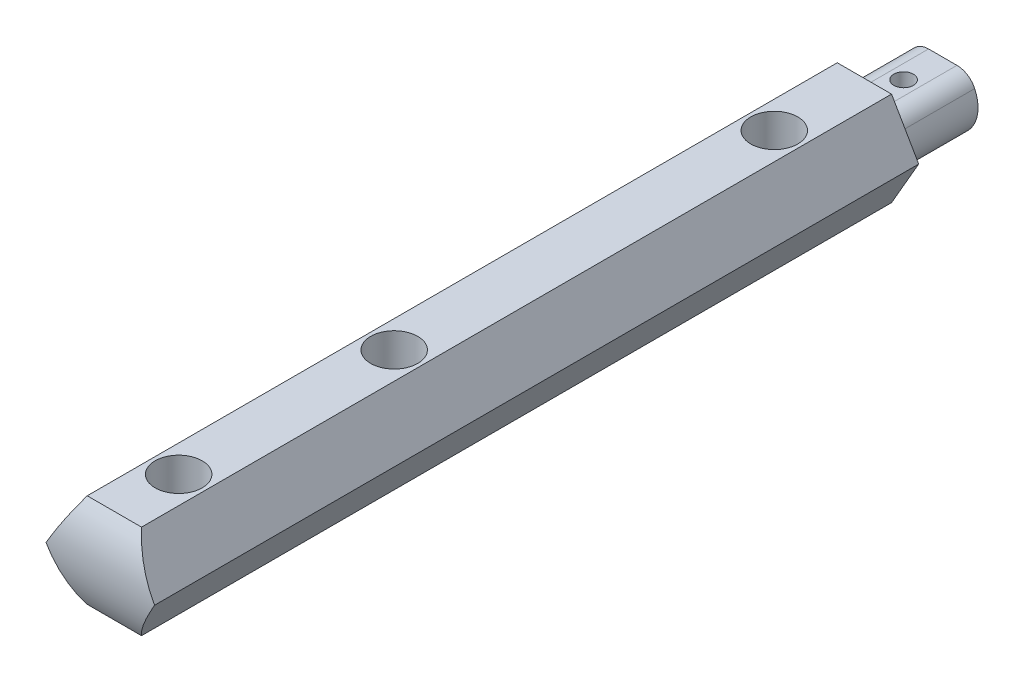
ISO-10303-21;
HEADER;
FILE_DESCRIPTION(('STEP AP214'),'2;1');
FILE_NAME('part.step','',(''),(''),'','','');
FILE_SCHEMA(('AUTOMOTIVE_DESIGN { 1 0 10303 214 1 1 1 1 }'));
ENDSEC;
DATA;
#1=APPLICATION_CONTEXT('core data for automotive mechanical design processes');
#2=APPLICATION_PROTOCOL_DEFINITION('international standard','automotive_design',2000,#1);
#3=PRODUCT_CONTEXT('',#1,'mechanical');
#4=PRODUCT('Part','Part','',(#3));
#5=PRODUCT_RELATED_PRODUCT_CATEGORY('part','',(#4));
#6=PRODUCT_DEFINITION_FORMATION('','',#4);
#7=PRODUCT_DEFINITION_CONTEXT('part definition',#1,'design');
#8=PRODUCT_DEFINITION('design','',#6,#7);
#9=PRODUCT_DEFINITION_SHAPE('','',#8);
#10=(LENGTH_UNIT() NAMED_UNIT(*) SI_UNIT(.MILLI.,.METRE.));
#11=(NAMED_UNIT(*) PLANE_ANGLE_UNIT() SI_UNIT($,.RADIAN.));
#12=(NAMED_UNIT(*) SI_UNIT($,.STERADIAN.) SOLID_ANGLE_UNIT());
#13=UNCERTAINTY_MEASURE_WITH_UNIT(LENGTH_MEASURE(1.E-05),#10,'distance_accuracy_value','');
#14=(GEOMETRIC_REPRESENTATION_CONTEXT(3) GLOBAL_UNCERTAINTY_ASSIGNED_CONTEXT((#13)) GLOBAL_UNIT_ASSIGNED_CONTEXT((#10,
#11,#12)) REPRESENTATION_CONTEXT('',''));
#15=CARTESIAN_POINT('',(0.,0.,0.));
#16=DIRECTION('',(0.,0.,1.));
#17=DIRECTION('',(1.,0.,0.));
#18=AXIS2_PLACEMENT_3D('',#15,#16,#17);
#19=CARTESIAN_POINT('',(0.,0.,0.));
#20=DIRECTION('',(0.,0.,1.));
#21=DIRECTION('',(1.,0.,0.));
#22=AXIS2_PLACEMENT_3D('',#19,#20,#21);
#23=PLANE('',#22);
#24=DIRECTION('',(-0.5,-0.866025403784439,0.));
#25=VECTOR('',#24,1.);
#26=CARTESIAN_POINT('',(-6.92820323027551,12.,0.));
#27=LINE('',#26,#25);
#28=CARTESIAN_POINT('',(-6.92820323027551,12.,0.));
#29=VERTEX_POINT('',#28);
#30=CARTESIAN_POINT('',(-13.856406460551,0.,0.));
#31=VERTEX_POINT('',#30);
#32=EDGE_CURVE('E161',#29,#31,#27,.T.);
#33=ORIENTED_EDGE('',*,*,#32,.F.);
#34=DIRECTION('',(-1.,0.,0.));
#35=VECTOR('',#34,1.);
#36=CARTESIAN_POINT('',(6.9282032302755,12.,0.));
#37=LINE('',#36,#35);
#38=CARTESIAN_POINT('',(6.9282032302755,12.,0.));
#39=VERTEX_POINT('',#38);
#40=EDGE_CURVE('E169',#39,#29,#37,.T.);
#41=ORIENTED_EDGE('',*,*,#40,.F.);
#42=DIRECTION('',(-0.5,0.866025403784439,0.));
#43=VECTOR('',#42,1.);
#44=CARTESIAN_POINT('',(13.856406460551,0.,0.));
#45=LINE('',#44,#43);
#46=CARTESIAN_POINT('',(13.856406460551,0.,0.));
#47=VERTEX_POINT('',#46);
#48=EDGE_CURVE('E164',#47,#39,#45,.T.);
#49=ORIENTED_EDGE('',*,*,#48,.F.);
#50=DIRECTION('',(0.499999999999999,0.866025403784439,0.));
#51=VECTOR('',#50,1.);
#52=CARTESIAN_POINT('',(6.92820323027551,-12.,0.));
#53=LINE('',#52,#51);
#54=CARTESIAN_POINT('',(6.92820323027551,-12.,0.));
#55=VERTEX_POINT('',#54);
#56=EDGE_CURVE('E138',#55,#47,#53,.T.);
#57=ORIENTED_EDGE('',*,*,#56,.F.);
#58=DIRECTION('',(1.,0.,0.));
#59=VECTOR('',#58,1.);
#60=CARTESIAN_POINT('',(-6.92820323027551,-12.,0.));
#61=LINE('',#60,#59);
#62=CARTESIAN_POINT('',(-6.92820323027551,-12.,0.));
#63=VERTEX_POINT('',#62);
#64=EDGE_CURVE('E152',#63,#55,#61,.T.);
#65=ORIENTED_EDGE('',*,*,#64,.F.);
#66=DIRECTION('',(0.5,-0.866025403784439,0.));
#67=VECTOR('',#66,1.);
#68=CARTESIAN_POINT('',(-13.856406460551,0.,0.));
#69=LINE('',#68,#67);
#70=EDGE_CURVE('E155',#31,#63,#69,.T.);
#71=ORIENTED_EDGE('',*,*,#70,.F.);
#72=EDGE_LOOP('',(#33,#41,#49,#57,#65,#71));
#73=FACE_BOUND('',#72,.T.);
#74=CARTESIAN_POINT('',(-3.62077339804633,1.7,0.));
#75=DIRECTION('',(0.,0.,-1.));
#76=DIRECTION('',(-1.,0.,0.));
#77=AXIS2_PLACEMENT_3D('',#74,#75,#76);
#78=CIRCLE('',#77,5.);
#79=CARTESIAN_POINT('',(-8.14674014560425,3.825,0.));
#80=VERTEX_POINT('',#79);
#81=CARTESIAN_POINT('',(-3.62077339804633,6.7,0.));
#82=VERTEX_POINT('',#81);
#83=EDGE_CURVE('E65',#80,#82,#78,.T.);
#84=ORIENTED_EDGE('',*,*,#83,.F.);
#85=CARTESIAN_POINT('',(0.,0.,0.));
#86=DIRECTION('',(0.,0.,-1.));
#87=DIRECTION('',(-1.,0.,0.));
#88=AXIS2_PLACEMENT_3D('',#85,#86,#87);
#89=CIRCLE('',#88,9.);
#90=CARTESIAN_POINT('',(8.14674014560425,3.825,0.));
#91=VERTEX_POINT('',#90);
#92=EDGE_CURVE('E191',#91,#80,#89,.T.);
#93=ORIENTED_EDGE('',*,*,#92,.F.);
#94=CARTESIAN_POINT('',(3.62077339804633,1.7,0.));
#95=DIRECTION('',(0.,0.,-1.));
#96=DIRECTION('',(-1.,0.,0.));
#97=AXIS2_PLACEMENT_3D('',#94,#95,#96);
#98=CIRCLE('',#97,5.);
#99=CARTESIAN_POINT('',(3.62077339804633,6.7,0.));
#100=VERTEX_POINT('',#99);
#101=EDGE_CURVE('E194',#100,#91,#98,.T.);
#102=ORIENTED_EDGE('',*,*,#101,.F.);
#103=DIRECTION('',(1.,0.,0.));
#104=VECTOR('',#103,1.);
#105=CARTESIAN_POINT('',(3.62077339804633,6.7,0.));
#106=LINE('',#105,#104);
#107=EDGE_CURVE('E197',#82,#100,#106,.T.);
#108=ORIENTED_EDGE('',*,*,#107,.F.);
#109=EDGE_LOOP('',(#84,#93,#102,#108));
#110=FACE_BOUND('',#109,.T.);
#111=ADVANCED_FACE('F36',(#73,#110),#23,.F.);
#112=CARTESIAN_POINT('',(-6.92820323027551,12.,195.));
#113=DIRECTION('',(0.866025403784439,-0.5,0.));
#114=DIRECTION('',(0.5,0.866025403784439,0.));
#115=AXIS2_PLACEMENT_3D('',#112,#113,#114);
#116=PLANE('',#115);
#117=DIRECTION('',(0.,0.,-1.));
#118=VECTOR('',#117,1.);
#119=CARTESIAN_POINT('',(-13.856406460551,0.,195.));
#120=LINE('',#119,#118);
#121=CARTESIAN_POINT('',(-13.856406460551,0.,195.));
#122=VERTEX_POINT('',#121);
#123=EDGE_CURVE('E11',#122,#31,#120,.T.);
#124=ORIENTED_EDGE('',*,*,#123,.F.);
#125=CARTESIAN_POINT('',(-13.856406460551,0.,173.153308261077));
#126=DIRECTION('',(0.866025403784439,-0.5,0.));
#127=DIRECTION('',(0.5,0.866025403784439,0.));
#128=AXIS2_PLACEMENT_3D('',#125,#126,#127);
#129=ELLIPSE('',#128,25.22638671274,21.846691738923);
#130=CARTESIAN_POINT('',(-6.92820323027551,12.,191.409209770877));
#131=VERTEX_POINT('',#130);
#132=EDGE_CURVE('E124',#122,#131,#129,.F.);
#133=ORIENTED_EDGE('',*,*,#132,.T.);
#134=DIRECTION('',(0.,0.,-1.));
#135=VECTOR('',#134,1.);
#136=CARTESIAN_POINT('',(-6.92820323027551,12.,195.));
#137=LINE('',#136,#135);
#138=EDGE_CURVE('E142',#131,#29,#137,.T.);
#139=ORIENTED_EDGE('',*,*,#138,.T.);
#140=ORIENTED_EDGE('',*,*,#32,.T.);
#141=EDGE_LOOP('',(#124,#133,#139,#140));
#142=FACE_BOUND('',#141,.T.);
#143=ADVANCED_FACE('F38',(#142),#116,.F.);
#144=CARTESIAN_POINT('',(-13.856406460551,0.,195.));
#145=DIRECTION('',(0.866025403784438,0.5,0.));
#146=DIRECTION('',(-0.5,0.866025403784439,0.));
#147=AXIS2_PLACEMENT_3D('',#144,#145,#146);
#148=PLANE('',#147);
#149=DIRECTION('',(0.,0.,-1.));
#150=VECTOR('',#149,1.);
#151=CARTESIAN_POINT('',(-6.92820323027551,-12.,195.));
#152=LINE('',#151,#150);
#153=CARTESIAN_POINT('',(-6.92820323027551,-12.,191.409209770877));
#154=VERTEX_POINT('',#153);
#155=EDGE_CURVE('E50',#154,#63,#152,.T.);
#156=ORIENTED_EDGE('',*,*,#155,.F.);
#157=CARTESIAN_POINT('',(-13.856406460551,0.,173.153308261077));
#158=DIRECTION('',(0.866025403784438,0.5,0.));
#159=DIRECTION('',(0.5,-0.866025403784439,0.));
#160=AXIS2_PLACEMENT_3D('',#157,#158,#159);
#161=ELLIPSE('',#160,25.22638671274,21.846691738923);
#162=EDGE_CURVE('E125',#154,#122,#161,.F.);
#163=ORIENTED_EDGE('',*,*,#162,.T.);
#164=ORIENTED_EDGE('',*,*,#123,.T.);
#165=ORIENTED_EDGE('',*,*,#70,.T.);
#166=EDGE_LOOP('',(#156,#163,#164,#165));
#167=FACE_BOUND('',#166,.T.);
#168=ADVANCED_FACE('F156',(#167),#148,.F.);
#169=CARTESIAN_POINT('',(-6.92820323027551,-12.,195.));
#170=DIRECTION('',(0.,1.,0.));
#171=DIRECTION('',(-1.,0.,0.));
#172=AXIS2_PLACEMENT_3D('',#169,#170,#171);
#173=PLANE('',#172);
#174=CARTESIAN_POINT('',(0.,-12.,23.));
#175=DIRECTION('',(0.,1.,0.));
#176=DIRECTION('',(0.,0.,1.));
#177=AXIS2_PLACEMENT_3D('',#174,#175,#176);
#178=CIRCLE('',#177,3.25);
#179=CARTESIAN_POINT('',(0.,-12.,26.25));
#180=VERTEX_POINT('',#179);
#181=EDGE_CURVE('E246',#180,#180,#178,.T.);
#182=ORIENTED_EDGE('',*,*,#181,.T.);
#183=EDGE_LOOP('',(#182));
#184=FACE_BOUND('',#183,.T.);
#185=CARTESIAN_POINT('',(0.,-12.,120.));
#186=DIRECTION('',(0.,-1.,0.));
#187=DIRECTION('',(0.,0.,-1.));
#188=AXIS2_PLACEMENT_3D('',#185,#186,#187);
#189=CIRCLE('',#188,4.00555020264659);
#190=CARTESIAN_POINT('',(0.,-12.,115.994449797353));
#191=VERTEX_POINT('',#190);
#192=EDGE_CURVE('E234',#191,#191,#189,.T.);
#193=ORIENTED_EDGE('',*,*,#192,.F.);
#194=EDGE_LOOP('',(#193));
#195=FACE_BOUND('',#194,.T.);
#196=CARTESIAN_POINT('',(0.,-12.,175.));
#197=DIRECTION('',(0.,-1.,0.));
#198=DIRECTION('',(0.,0.,-1.));
#199=AXIS2_PLACEMENT_3D('',#196,#197,#198);
#200=CIRCLE('',#199,4.00555020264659);
#201=CARTESIAN_POINT('',(0.,-12.,170.994449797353));
#202=VERTEX_POINT('',#201);
#203=EDGE_CURVE('E222',#202,#202,#200,.T.);
#204=ORIENTED_EDGE('',*,*,#203,.F.);
#205=EDGE_LOOP('',(#204));
#206=FACE_BOUND('',#205,.T.);
#207=DIRECTION('',(0.,0.,-1.));
#208=VECTOR('',#207,1.);
#209=CARTESIAN_POINT('',(6.92820323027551,-12.,195.));
#210=LINE('',#209,#208);
#211=CARTESIAN_POINT('',(6.92820323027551,-12.,191.409209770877));
#212=VERTEX_POINT('',#211);
#213=EDGE_CURVE('E139',#212,#55,#210,.T.);
#214=ORIENTED_EDGE('',*,*,#213,.F.);
#215=DIRECTION('',(1.,0.,0.));
#216=VECTOR('',#215,1.);
#217=CARTESIAN_POINT('',(-13.856406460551,-12.,191.409209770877));
#218=LINE('',#217,#216);
#219=EDGE_CURVE('E120',#154,#212,#218,.T.);
#220=ORIENTED_EDGE('',*,*,#219,.F.);
#221=ORIENTED_EDGE('',*,*,#155,.T.);
#222=ORIENTED_EDGE('',*,*,#64,.T.);
#223=EDGE_LOOP('',(#214,#220,#221,#222));
#224=FACE_BOUND('',#223,.T.);
#225=ADVANCED_FACE('F150',(#184,#195,#206,#224),#173,.F.);
#226=CARTESIAN_POINT('',(6.92820323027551,-12.,195.));
#227=DIRECTION('',(-0.866025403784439,0.499999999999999,0.));
#228=DIRECTION('',(-0.499999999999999,-0.866025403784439,0.));
#229=AXIS2_PLACEMENT_3D('',#226,#227,#228);
#230=PLANE('',#229);
#231=DIRECTION('',(0.,0.,-1.));
#232=VECTOR('',#231,1.);
#233=CARTESIAN_POINT('',(13.856406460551,0.,195.));
#234=LINE('',#233,#232);
#235=CARTESIAN_POINT('',(13.856406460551,0.,195.));
#236=VERTEX_POINT('',#235);
#237=EDGE_CURVE('E132',#236,#47,#234,.T.);
#238=ORIENTED_EDGE('',*,*,#237,.F.);
#239=CARTESIAN_POINT('',(13.856406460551,0.,173.153308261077));
#240=DIRECTION('',(-0.866025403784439,0.499999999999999,0.));
#241=DIRECTION('',(0.499999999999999,0.866025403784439,0.));
#242=AXIS2_PLACEMENT_3D('',#239,#240,#241);
#243=ELLIPSE('',#242,25.22638671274,21.846691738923);
#244=EDGE_CURVE('E117',#236,#212,#243,.F.);
#245=ORIENTED_EDGE('',*,*,#244,.T.);
#246=ORIENTED_EDGE('',*,*,#213,.T.);
#247=ORIENTED_EDGE('',*,*,#56,.T.);
#248=EDGE_LOOP('',(#238,#245,#246,#247));
#249=FACE_BOUND('',#248,.T.);
#250=ADVANCED_FACE('F136',(#249),#230,.F.);
#251=CARTESIAN_POINT('',(13.856406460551,0.,195.));
#252=DIRECTION('',(-0.866025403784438,-0.5,0.));
#253=DIRECTION('',(0.5,-0.866025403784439,0.));
#254=AXIS2_PLACEMENT_3D('',#251,#252,#253);
#255=PLANE('',#254);
#256=DIRECTION('',(0.,0.,-1.));
#257=VECTOR('',#256,1.);
#258=CARTESIAN_POINT('',(6.9282032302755,12.,195.));
#259=LINE('',#258,#257);
#260=CARTESIAN_POINT('',(6.9282032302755,12.,191.409209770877));
#261=VERTEX_POINT('',#260);
#262=EDGE_CURVE('E134',#261,#39,#259,.T.);
#263=ORIENTED_EDGE('',*,*,#262,.F.);
#264=CARTESIAN_POINT('',(13.856406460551,0.,173.153308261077));
#265=DIRECTION('',(-0.866025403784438,-0.5,0.));
#266=DIRECTION('',(0.5,-0.866025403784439,0.));
#267=AXIS2_PLACEMENT_3D('',#264,#265,#266);
#268=ELLIPSE('',#267,25.22638671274,21.846691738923);
#269=EDGE_CURVE('E57',#261,#236,#268,.F.);
#270=ORIENTED_EDGE('',*,*,#269,.T.);
#271=ORIENTED_EDGE('',*,*,#237,.T.);
#272=ORIENTED_EDGE('',*,*,#48,.T.);
#273=EDGE_LOOP('',(#263,#270,#271,#272));
#274=FACE_BOUND('',#273,.T.);
#275=ADVANCED_FACE('F130',(#274),#255,.F.);
#276=CARTESIAN_POINT('',(6.9282032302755,12.,195.));
#277=DIRECTION('',(0.,-1.,0.));
#278=DIRECTION('',(0.,0.,-1.));
#279=AXIS2_PLACEMENT_3D('',#276,#277,#278);
#280=PLANE('',#279);
#281=CARTESIAN_POINT('',(0.,12.,23.));
#282=DIRECTION('',(0.,1.,0.));
#283=DIRECTION('',(0.,0.,1.));
#284=AXIS2_PLACEMENT_3D('',#281,#282,#283);
#285=CIRCLE('',#284,6.);
#286=CARTESIAN_POINT('',(0.,12.,29.));
#287=VERTEX_POINT('',#286);
#288=EDGE_CURVE('E237',#287,#287,#285,.T.);
#289=ORIENTED_EDGE('',*,*,#288,.F.);
#290=EDGE_LOOP('',(#289));
#291=FACE_BOUND('',#290,.T.);
#292=CARTESIAN_POINT('',(0.,12.,120.));
#293=DIRECTION('',(0.,-1.,0.));
#294=DIRECTION('',(0.,0.,-1.));
#295=AXIS2_PLACEMENT_3D('',#292,#293,#294);
#296=CIRCLE('',#295,6.00000000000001);
#297=CARTESIAN_POINT('',(0.,12.,114.));
#298=VERTEX_POINT('',#297);
#299=EDGE_CURVE('E225',#298,#298,#296,.T.);
#300=ORIENTED_EDGE('',*,*,#299,.T.);
#301=EDGE_LOOP('',(#300));
#302=FACE_BOUND('',#301,.T.);
#303=CARTESIAN_POINT('',(0.,12.,175.));
#304=DIRECTION('',(0.,-1.,0.));
#305=DIRECTION('',(0.,0.,-1.));
#306=AXIS2_PLACEMENT_3D('',#303,#304,#305);
#307=CIRCLE('',#306,6.00000000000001);
#308=CARTESIAN_POINT('',(0.,12.,169.));
#309=VERTEX_POINT('',#308);
#310=EDGE_CURVE('E212',#309,#309,#307,.T.);
#311=ORIENTED_EDGE('',*,*,#310,.T.);
#312=EDGE_LOOP('',(#311));
#313=FACE_BOUND('',#312,.T.);
#314=ORIENTED_EDGE('',*,*,#138,.F.);
#315=DIRECTION('',(1.,0.,0.));
#316=VECTOR('',#315,1.);
#317=CARTESIAN_POINT('',(-13.856406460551,12.,191.409209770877));
#318=LINE('',#317,#316);
#319=EDGE_CURVE('E210',#131,#261,#318,.T.);
#320=ORIENTED_EDGE('',*,*,#319,.T.);
#321=ORIENTED_EDGE('',*,*,#262,.T.);
#322=ORIENTED_EDGE('',*,*,#40,.T.);
#323=EDGE_LOOP('',(#314,#320,#321,#322));
#324=FACE_BOUND('',#323,.T.);
#325=ADVANCED_FACE('F176',(#291,#302,#313,#324),#280,.F.);
#326=CARTESIAN_POINT('',(-3.62077339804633,1.7,-20.));
#327=DIRECTION('',(0.,0.,1.));
#328=DIRECTION('',(1.,0.,0.));
#329=AXIS2_PLACEMENT_3D('',#326,#327,#328);
#330=CYLINDRICAL_SURFACE('',#329,5.);
#331=ORIENTED_EDGE('',*,*,#83,.T.);
#332=DIRECTION('',(0.,0.,1.));
#333=VECTOR('',#332,1.);
#334=CARTESIAN_POINT('',(-3.62077339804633,6.7,-20.));
#335=LINE('',#334,#333);
#336=CARTESIAN_POINT('',(-3.62077339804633,6.7,-20.));
#337=VERTEX_POINT('',#336);
#338=EDGE_CURVE('E177',#337,#82,#335,.T.);
#339=ORIENTED_EDGE('',*,*,#338,.F.);
#340=CARTESIAN_POINT('',(-3.62077339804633,1.7,-20.));
#341=DIRECTION('',(0.,0.,-1.));
#342=DIRECTION('',(-1.,0.,0.));
#343=AXIS2_PLACEMENT_3D('',#340,#341,#342);
#344=CIRCLE('',#343,5.);
#345=CARTESIAN_POINT('',(-8.14674014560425,3.825,-20.));
#346=VERTEX_POINT('',#345);
#347=EDGE_CURVE('E193',#346,#337,#344,.T.);
#348=ORIENTED_EDGE('',*,*,#347,.F.);
#349=DIRECTION('',(0.,0.,1.));
#350=VECTOR('',#349,1.);
#351=CARTESIAN_POINT('',(-8.14674014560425,3.825,-20.));
#352=LINE('',#351,#350);
#353=EDGE_CURVE('E187',#346,#80,#352,.T.);
#354=ORIENTED_EDGE('',*,*,#353,.T.);
#355=EDGE_LOOP('',(#331,#339,#348,#354));
#356=FACE_BOUND('',#355,.T.);
#357=ADVANCED_FACE('F276',(#356),#330,.T.);
#358=CARTESIAN_POINT('',(3.62077339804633,6.7,-20.));
#359=DIRECTION('',(0.,-1.,0.));
#360=DIRECTION('',(1.,0.,0.));
#361=AXIS2_PLACEMENT_3D('',#358,#359,#360);
#362=PLANE('',#361);
#363=CARTESIAN_POINT('',(0.,6.7,-10.));
#364=DIRECTION('',(0.,1.,0.));
#365=DIRECTION('',(0.,0.,1.));
#366=AXIS2_PLACEMENT_3D('',#363,#364,#365);
#367=CIRCLE('',#366,2.49999999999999);
#368=CARTESIAN_POINT('',(0.,6.7,-7.50000000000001));
#369=VERTEX_POINT('',#368);
#370=EDGE_CURVE('E249',#369,#369,#367,.T.);
#371=ORIENTED_EDGE('',*,*,#370,.F.);
#372=EDGE_LOOP('',(#371));
#373=FACE_BOUND('',#372,.T.);
#374=ORIENTED_EDGE('',*,*,#107,.T.);
#375=DIRECTION('',(0.,0.,1.));
#376=VECTOR('',#375,1.);
#377=CARTESIAN_POINT('',(3.62077339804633,6.7,-20.));
#378=LINE('',#377,#376);
#379=CARTESIAN_POINT('',(3.62077339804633,6.7,-20.));
#380=VERTEX_POINT('',#379);
#381=EDGE_CURVE('E179',#380,#100,#378,.T.);
#382=ORIENTED_EDGE('',*,*,#381,.F.);
#383=DIRECTION('',(1.,0.,0.));
#384=VECTOR('',#383,1.);
#385=CARTESIAN_POINT('',(3.62077339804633,6.7,-20.));
#386=LINE('',#385,#384);
#387=EDGE_CURVE('E204',#337,#380,#386,.T.);
#388=ORIENTED_EDGE('',*,*,#387,.F.);
#389=ORIENTED_EDGE('',*,*,#338,.T.);
#390=EDGE_LOOP('',(#374,#382,#388,#389));
#391=FACE_BOUND('',#390,.T.);
#392=ADVANCED_FACE('F317',(#373,#391),#362,.F.);
#393=CARTESIAN_POINT('',(3.62077339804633,1.7,-20.));
#394=DIRECTION('',(0.,0.,1.));
#395=DIRECTION('',(1.,0.,0.));
#396=AXIS2_PLACEMENT_3D('',#393,#394,#395);
#397=CYLINDRICAL_SURFACE('',#396,5.);
#398=ORIENTED_EDGE('',*,*,#101,.T.);
#399=DIRECTION('',(0.,0.,1.));
#400=VECTOR('',#399,1.);
#401=CARTESIAN_POINT('',(8.14674014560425,3.825,-20.));
#402=LINE('',#401,#400);
#403=CARTESIAN_POINT('',(8.14674014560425,3.825,-20.));
#404=VERTEX_POINT('',#403);
#405=EDGE_CURVE('E184',#404,#91,#402,.T.);
#406=ORIENTED_EDGE('',*,*,#405,.F.);
#407=CARTESIAN_POINT('',(3.62077339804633,1.7,-20.));
#408=DIRECTION('',(0.,0.,-1.));
#409=DIRECTION('',(-1.,0.,0.));
#410=AXIS2_PLACEMENT_3D('',#407,#408,#409);
#411=CIRCLE('',#410,5.);
#412=EDGE_CURVE('E202',#380,#404,#411,.T.);
#413=ORIENTED_EDGE('',*,*,#412,.F.);
#414=ORIENTED_EDGE('',*,*,#381,.T.);
#415=EDGE_LOOP('',(#398,#406,#413,#414));
#416=FACE_BOUND('',#415,.T.);
#417=ADVANCED_FACE('F325',(#416),#397,.T.);
#418=CARTESIAN_POINT('',(0.,0.,-20.));
#419=DIRECTION('',(0.,0.,1.));
#420=DIRECTION('',(1.,0.,0.));
#421=AXIS2_PLACEMENT_3D('',#418,#419,#420);
#422=CYLINDRICAL_SURFACE('',#421,9.);
#423=CARTESIAN_POINT('',(0.,-9.,-7.50000000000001));
#424=CARTESIAN_POINT('',(0.13760250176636,-8.99999816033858,-7.50000279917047));
#425=CARTESIAN_POINT('',(0.275234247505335,-8.99681348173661,-7.51139863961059));
#426=CARTESIAN_POINT('',(0.546518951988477,-8.98441900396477,-7.55659145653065));
#427=CARTESIAN_POINT('',(0.680170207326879,-8.97520666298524,-7.59039788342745));
#428=CARTESIAN_POINT('',(0.939539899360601,-8.95177130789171,-7.67921743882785));
#429=CARTESIAN_POINT('',(1.06526878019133,-8.9375550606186,-7.73420193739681));
#430=CARTESIAN_POINT('',(1.30572139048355,-8.90560625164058,-7.86370701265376));
#431=CARTESIAN_POINT('',(1.4204441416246,-8.88787337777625,-7.9382293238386));
#432=CARTESIAN_POINT('',(1.63849356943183,-8.85030315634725,-8.10665886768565));
#433=CARTESIAN_POINT('',(1.7415062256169,-8.8304274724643,-8.20096407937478));
#434=CARTESIAN_POINT('',(1.93047637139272,-8.79105214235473,-8.40543255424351));
#435=CARTESIAN_POINT('',(2.01643146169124,-8.77155254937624,-8.51559804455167));
#436=CARTESIAN_POINT('',(2.1704161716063,-8.73474088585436,-8.75121452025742));
#437=CARTESIAN_POINT('',(2.23807749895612,-8.71747695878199,-8.87691441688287));
#438=CARTESIAN_POINT('',(2.35117914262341,-8.68765801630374,-9.13846383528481));
#439=CARTESIAN_POINT('',(2.39662394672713,-8.67510204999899,-9.27431130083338));
#440=CARTESIAN_POINT('',(2.46289848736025,-8.65651766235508,-9.54880557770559));
#441=CARTESIAN_POINT('',(2.48430073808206,-8.65033771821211,-9.68730364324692));
#442=CARTESIAN_POINT('',(2.50366854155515,-8.644752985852,-9.96605177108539));
#443=CARTESIAN_POINT('',(2.50163888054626,-8.64534681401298,-10.1063014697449));
#444=CARTESIAN_POINT('',(2.4746534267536,-8.65310733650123,-10.3800445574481));
#445=CARTESIAN_POINT('',(2.45039804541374,-8.66007321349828,-10.5136136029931));
#446=CARTESIAN_POINT('',(2.38077462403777,-8.67947034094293,-10.7747072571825));
#447=CARTESIAN_POINT('',(2.33540476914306,-8.6919020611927,-10.9022313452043));
#448=CARTESIAN_POINT('',(2.22428746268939,-8.72100139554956,-11.1494044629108));
#449=CARTESIAN_POINT('',(2.15830043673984,-8.7377183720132,-11.2689397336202));
#450=CARTESIAN_POINT('',(2.00798881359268,-8.77347901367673,-11.4954831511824));
#451=CARTESIAN_POINT('',(1.92366033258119,-8.79252317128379,-11.6024886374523));
#452=CARTESIAN_POINT('',(1.73551122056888,-8.83162144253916,-11.8049277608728));
#453=CARTESIAN_POINT('',(1.63110455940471,-8.85168740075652,-11.8998152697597));
#454=CARTESIAN_POINT('',(1.40761321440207,-8.88996399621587,-12.0708514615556));
#455=CARTESIAN_POINT('',(1.28852785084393,-8.90817454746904,-12.146999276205));
#456=CARTESIAN_POINT('',(1.03816685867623,-8.94081679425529,-12.2786636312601));
#457=CARTESIAN_POINT('',(0.906832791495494,-8.95522897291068,-12.3340742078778));
#458=CARTESIAN_POINT('',(0.636219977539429,-8.97850985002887,-12.4218681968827));
#459=CARTESIAN_POINT('',(0.49694312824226,-8.98737986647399,-12.4542570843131));
#460=CARTESIAN_POINT('',(0.219053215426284,-8.99837472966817,-12.4942142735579));
#461=CARTESIAN_POINT('',(0.0805546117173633,-9.00070107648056,-12.5025242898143));
#462=CARTESIAN_POINT('',(-0.195859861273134,-8.99892960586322,-12.4961460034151));
#463=CARTESIAN_POINT('',(-0.333775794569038,-8.9948325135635,-12.4814602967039));
#464=CARTESIAN_POINT('',(-0.602413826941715,-8.98080530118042,-12.4301133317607));
#465=CARTESIAN_POINT('',(-0.733222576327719,-8.97098674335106,-12.393872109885));
#466=CARTESIAN_POINT('',(-0.986886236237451,-8.94663658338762,-12.3009362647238));
#467=CARTESIAN_POINT('',(-1.10974024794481,-8.93210444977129,-12.2442393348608));
#468=CARTESIAN_POINT('',(-1.34684028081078,-8.89947480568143,-12.1106682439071));
#469=CARTESIAN_POINT('',(-1.4608541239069,-8.88130942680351,-12.0333989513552));
#470=CARTESIAN_POINT('',(-1.67455534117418,-8.84350954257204,-11.8613677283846));
#471=CARTESIAN_POINT('',(-1.77423962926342,-8.82387472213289,-11.7666020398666));
#472=CARTESIAN_POINT('',(-1.9596240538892,-8.78459685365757,-11.5587971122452));
#473=CARTESIAN_POINT('',(-2.04479915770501,-8.76497216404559,-11.4452850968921));
#474=CARTESIAN_POINT('',(-2.1949116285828,-8.72859386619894,-11.2051587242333));
#475=CARTESIAN_POINT('',(-2.25984976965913,-8.71184014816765,-11.0785448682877));
#476=CARTESIAN_POINT('',(-2.36716211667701,-8.68329597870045,-10.8163856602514));
#477=CARTESIAN_POINT('',(-2.4096615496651,-8.67147806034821,-10.6808947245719));
#478=CARTESIAN_POINT('',(-2.47115304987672,-8.65415753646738,-10.4043005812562));
#479=CARTESIAN_POINT('',(-2.4901517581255,-8.64865314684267,-10.2631989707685));
#480=CARTESIAN_POINT('',(-2.50369719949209,-8.64474076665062,-9.98478844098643));
#481=CARTESIAN_POINT('',(-2.49909142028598,-8.64608680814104,-9.84752361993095));
#482=CARTESIAN_POINT('',(-2.46754286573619,-8.65514273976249,-9.57581021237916));
#483=CARTESIAN_POINT('',(-2.44060076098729,-8.66285243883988,-9.44136154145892));
#484=CARTESIAN_POINT('',(-2.36565448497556,-8.68361437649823,-9.18026553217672));
#485=CARTESIAN_POINT('',(-2.31784429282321,-8.69661733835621,-9.05355831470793));
#486=CARTESIAN_POINT('',(-2.20266903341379,-8.72649832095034,-8.80986515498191));
#487=CARTESIAN_POINT('',(-2.13530066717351,-8.74337699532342,-8.69288085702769));
#488=CARTESIAN_POINT('',(-1.98041392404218,-8.77977621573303,-8.46794469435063));
#489=CARTESIAN_POINT('',(-1.89232416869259,-8.79936357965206,-8.36039704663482));
#490=CARTESIAN_POINT('',(-1.69956305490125,-8.83861663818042,-8.16133525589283));
#491=CARTESIAN_POINT('',(-1.59488759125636,-8.85828235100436,-8.06982509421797));
#492=CARTESIAN_POINT('',(-1.36892046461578,-8.89603679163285,-7.90328372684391));
#493=CARTESIAN_POINT('',(-1.24729251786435,-8.91407682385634,-7.82869675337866));
#494=CARTESIAN_POINT('',(-0.992723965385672,-8.94599949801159,-7.70114372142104));
#495=CARTESIAN_POINT('',(-0.859790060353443,-8.95988458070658,-7.64816496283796));
#496=CARTESIAN_POINT('',(-0.606290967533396,-8.98032149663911,-7.57155983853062));
#497=CARTESIAN_POINT('',(-0.486728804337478,-8.98764491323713,-7.54479042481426));
#498=CARTESIAN_POINT('',(-0.244785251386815,-8.99748469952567,-7.50901030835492));
#499=CARTESIAN_POINT('',(-0.122404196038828,-9.00000163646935,-7.49999751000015));
#500=CARTESIAN_POINT('',(0.,-9.,-7.50000000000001));
#501=B_SPLINE_CURVE_WITH_KNOTS('',3,(#423,#424,#425,#426,#427,#428,#429,#430,#431,#432,#433,
#434,#435,#436,#437,#438,#439,#440,#441,#442,#443,#444,#445,#446,#447,#448,#449,#450,#451,#452,
#453,#454,#455,#456,#457,#458,#459,#460,#461,#462,#463,#464,#465,#466,#467,#468,#469,#470,#471,
#472,#473,#474,#475,#476,#477,#478,#479,#480,#481,#482,#483,#484,#485,#486,#487,#488,#489,#490,
#491,#492,#493,#494,#495,#496,#497,#498,#499,#500),.UNSPECIFIED.,.T.,.F.,(4,2,2,2,2,2,2,2,2,2,2,
2,2,2,2,2,2,2,2,2,2,2,2,2,2,2,2,2,2,2,2,2,2,2,2,2,2,2,4),(0.,0.41235838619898,0.824890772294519,
1.23686741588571,1.64888064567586,2.07015248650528,2.4914835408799,2.92075380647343,
3.34993732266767,3.76866863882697,4.18731442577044,4.59320465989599,4.99912978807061,
5.40995920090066,5.82087569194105,6.24638987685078,6.67192377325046,7.09960331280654,
7.52718110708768,7.94144021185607,8.35565255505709,8.76204634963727,9.16848598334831,
9.58337897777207,9.99836119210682,10.4261198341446,10.8538621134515,11.279191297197,
11.7044002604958,12.1144519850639,12.5244913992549,12.9307978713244,13.3371729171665,
13.7564382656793,14.1758075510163,14.6051618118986,15.0342633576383,15.4011197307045,
15.7679328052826),.UNSPECIFIED.);
#502=CARTESIAN_POINT('',(0.,-9.,-7.50000000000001));
#503=VERTEX_POINT('',#502);
#504=EDGE_CURVE('E40',#503,#503,#501,.T.);
#505=ORIENTED_EDGE('',*,*,#504,.T.);
#506=EDGE_LOOP('',(#505));
#507=FACE_BOUND('',#506,.T.);
#508=ORIENTED_EDGE('',*,*,#92,.T.);
#509=ORIENTED_EDGE('',*,*,#353,.F.);
#510=CARTESIAN_POINT('',(0.,0.,-20.));
#511=DIRECTION('',(0.,0.,-1.));
#512=DIRECTION('',(-1.,0.,0.));
#513=AXIS2_PLACEMENT_3D('',#510,#511,#512);
#514=CIRCLE('',#513,9.);
#515=EDGE_CURVE('E190',#404,#346,#514,.T.);
#516=ORIENTED_EDGE('',*,*,#515,.F.);
#517=ORIENTED_EDGE('',*,*,#405,.T.);
#518=EDGE_LOOP('',(#508,#509,#516,#517));
#519=FACE_BOUND('',#518,.T.);
#520=ADVANCED_FACE('F256',(#507,#519),#422,.T.);
#521=CARTESIAN_POINT('',(-3.62077339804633,1.7,-20.));
#522=DIRECTION('',(0.,0.,-1.));
#523=DIRECTION('',(-1.,0.,0.));
#524=AXIS2_PLACEMENT_3D('',#521,#522,#523);
#525=PLANE('',#524);
#526=ORIENTED_EDGE('',*,*,#347,.T.);
#527=ORIENTED_EDGE('',*,*,#387,.T.);
#528=ORIENTED_EDGE('',*,*,#412,.T.);
#529=ORIENTED_EDGE('',*,*,#515,.T.);
#530=EDGE_LOOP('',(#526,#527,#528,#529));
#531=FACE_BOUND('',#530,.T.);
#532=ADVANCED_FACE('F340',(#531),#525,.T.);
#533=CARTESIAN_POINT('',(-13.856406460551,0.,173.153308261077));
#534=DIRECTION('',(1.,0.,0.));
#535=DIRECTION('',(0.,0.,-1.));
#536=AXIS2_PLACEMENT_3D('',#533,#534,#535);
#537=CYLINDRICAL_SURFACE('',#536,21.846691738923);
#538=ORIENTED_EDGE('',*,*,#132,.F.);
#539=ORIENTED_EDGE('',*,*,#162,.F.);
#540=ORIENTED_EDGE('',*,*,#219,.T.);
#541=ORIENTED_EDGE('',*,*,#244,.F.);
#542=ORIENTED_EDGE('',*,*,#269,.F.);
#543=ORIENTED_EDGE('',*,*,#319,.F.);
#544=EDGE_LOOP('',(#538,#539,#540,#541,#542,#543));
#545=FACE_BOUND('',#544,.T.);
#546=ADVANCED_FACE('F118',(#545),#537,.T.);
#547=CARTESIAN_POINT('',(0.,-12.,175.));
#548=DIRECTION('',(0.,-1.,0.));
#549=DIRECTION('',(0.,0.,-1.));
#550=AXIS2_PLACEMENT_3D('',#547,#548,#549);
#551=CYLINDRICAL_SURFACE('',#550,6.00000000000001);
#552=ORIENTED_EDGE('',*,*,#310,.F.);
#553=EDGE_LOOP('',(#552));
#554=FACE_BOUND('',#553,.T.);
#555=CARTESIAN_POINT('',(0.,0.,175.));
#556=DIRECTION('',(0.,-1.,0.));
#557=DIRECTION('',(0.,0.,-1.));
#558=AXIS2_PLACEMENT_3D('',#555,#556,#557);
#559=CIRCLE('',#558,6.00000000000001);
#560=CARTESIAN_POINT('',(0.,0.,169.));
#561=VERTEX_POINT('',#560);
#562=EDGE_CURVE('E216',#561,#561,#559,.T.);
#563=ORIENTED_EDGE('',*,*,#562,.T.);
#564=EDGE_LOOP('',(#563));
#565=FACE_BOUND('',#564,.T.);
#566=ADVANCED_FACE('F352',(#554,#565),#551,.F.);
#567=CARTESIAN_POINT('',(0.,0.,169.));
#568=DIRECTION('',(0.,-1.,0.));
#569=DIRECTION('',(0.,0.,-1.));
#570=AXIS2_PLACEMENT_3D('',#567,#568,#569);
#571=PLANE('',#570);
#572=ORIENTED_EDGE('',*,*,#562,.F.);
#573=EDGE_LOOP('',(#572));
#574=FACE_BOUND('',#573,.T.);
#575=CARTESIAN_POINT('',(0.,0.,175.));
#576=DIRECTION('',(0.,-1.,0.));
#577=DIRECTION('',(0.,0.,-1.));
#578=AXIS2_PLACEMENT_3D('',#575,#576,#577);
#579=CIRCLE('',#578,4.00555020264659);
#580=CARTESIAN_POINT('',(0.,0.,170.994449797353));
#581=VERTEX_POINT('',#580);
#582=EDGE_CURVE('E219',#581,#581,#579,.T.);
#583=ORIENTED_EDGE('',*,*,#582,.T.);
#584=EDGE_LOOP('',(#583));
#585=FACE_BOUND('',#584,.T.);
#586=ADVANCED_FACE('F359',(#574,#585),#571,.F.);
#587=CARTESIAN_POINT('',(0.,-12.,175.));
#588=DIRECTION('',(0.,-1.,0.));
#589=DIRECTION('',(0.,0.,-1.));
#590=AXIS2_PLACEMENT_3D('',#587,#588,#589);
#591=CYLINDRICAL_SURFACE('',#590,4.00555020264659);
#592=ORIENTED_EDGE('',*,*,#582,.F.);
#593=EDGE_LOOP('',(#592));
#594=FACE_BOUND('',#593,.T.);
#595=ORIENTED_EDGE('',*,*,#203,.T.);
#596=EDGE_LOOP('',(#595));
#597=FACE_BOUND('',#596,.T.);
#598=ADVANCED_FACE('F367',(#594,#597),#591,.F.);
#599=CARTESIAN_POINT('',(0.,-12.,120.));
#600=DIRECTION('',(0.,-1.,0.));
#601=DIRECTION('',(0.,0.,-1.));
#602=AXIS2_PLACEMENT_3D('',#599,#600,#601);
#603=CYLINDRICAL_SURFACE('',#602,6.00000000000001);
#604=ORIENTED_EDGE('',*,*,#299,.F.);
#605=EDGE_LOOP('',(#604));
#606=FACE_BOUND('',#605,.T.);
#607=CARTESIAN_POINT('',(0.,0.,120.));
#608=DIRECTION('',(0.,-1.,0.));
#609=DIRECTION('',(0.,0.,-1.));
#610=AXIS2_PLACEMENT_3D('',#607,#608,#609);
#611=CIRCLE('',#610,6.00000000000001);
#612=CARTESIAN_POINT('',(0.,0.,114.));
#613=VERTEX_POINT('',#612);
#614=EDGE_CURVE('E228',#613,#613,#611,.T.);
#615=ORIENTED_EDGE('',*,*,#614,.T.);
#616=EDGE_LOOP('',(#615));
#617=FACE_BOUND('',#616,.T.);
#618=ADVANCED_FACE('F375',(#606,#617),#603,.F.);
#619=CARTESIAN_POINT('',(0.,0.,114.));
#620=DIRECTION('',(0.,-1.,0.));
#621=DIRECTION('',(0.,0.,-1.));
#622=AXIS2_PLACEMENT_3D('',#619,#620,#621);
#623=PLANE('',#622);
#624=ORIENTED_EDGE('',*,*,#614,.F.);
#625=EDGE_LOOP('',(#624));
#626=FACE_BOUND('',#625,.T.);
#627=CARTESIAN_POINT('',(0.,0.,120.));
#628=DIRECTION('',(0.,-1.,0.));
#629=DIRECTION('',(0.,0.,-1.));
#630=AXIS2_PLACEMENT_3D('',#627,#628,#629);
#631=CIRCLE('',#630,4.00555020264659);
#632=CARTESIAN_POINT('',(0.,0.,115.994449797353));
#633=VERTEX_POINT('',#632);
#634=EDGE_CURVE('E231',#633,#633,#631,.T.);
#635=ORIENTED_EDGE('',*,*,#634,.T.);
#636=EDGE_LOOP('',(#635));
#637=FACE_BOUND('',#636,.T.);
#638=ADVANCED_FACE('F383',(#626,#637),#623,.F.);
#639=CARTESIAN_POINT('',(0.,-12.,120.));
#640=DIRECTION('',(0.,-1.,0.));
#641=DIRECTION('',(0.,0.,-1.));
#642=AXIS2_PLACEMENT_3D('',#639,#640,#641);
#643=CYLINDRICAL_SURFACE('',#642,4.00555020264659);
#644=ORIENTED_EDGE('',*,*,#634,.F.);
#645=EDGE_LOOP('',(#644));
#646=FACE_BOUND('',#645,.T.);
#647=ORIENTED_EDGE('',*,*,#192,.T.);
#648=EDGE_LOOP('',(#647));
#649=FACE_BOUND('',#648,.T.);
#650=ADVANCED_FACE('F391',(#646,#649),#643,.F.);
#651=CARTESIAN_POINT('',(0.,21.5129249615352,23.));
#652=DIRECTION('',(0.,1.,0.));
#653=DIRECTION('',(0.,0.,1.));
#654=AXIS2_PLACEMENT_3D('',#651,#652,#653);
#655=CYLINDRICAL_SURFACE('',#654,6.);
#656=CARTESIAN_POINT('',(0.,-3.,23.));
#657=DIRECTION('',(0.,1.,0.));
#658=DIRECTION('',(0.,0.,1.));
#659=AXIS2_PLACEMENT_3D('',#656,#657,#658);
#660=CIRCLE('',#659,6.);
#661=CARTESIAN_POINT('',(0.,-3.,29.));
#662=VERTEX_POINT('',#661);
#663=EDGE_CURVE('E240',#662,#662,#660,.T.);
#664=ORIENTED_EDGE('',*,*,#663,.F.);
#665=EDGE_LOOP('',(#664));
#666=FACE_BOUND('',#665,.T.);
#667=ORIENTED_EDGE('',*,*,#288,.T.);
#668=EDGE_LOOP('',(#667));
#669=FACE_BOUND('',#668,.T.);
#670=ADVANCED_FACE('F398',(#666,#669),#655,.F.);
#671=CARTESIAN_POINT('',(0.,-3.,29.));
#672=DIRECTION('',(0.,-1.,0.));
#673=DIRECTION('',(0.,0.,-1.));
#674=AXIS2_PLACEMENT_3D('',#671,#672,#673);
#675=PLANE('',#674);
#676=CARTESIAN_POINT('',(0.,-3.,23.));
#677=DIRECTION('',(0.,1.,0.));
#678=DIRECTION('',(0.,0.,1.));
#679=AXIS2_PLACEMENT_3D('',#676,#677,#678);
#680=CIRCLE('',#679,3.24999999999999);
#681=CARTESIAN_POINT('',(0.,-3.,26.25));
#682=VERTEX_POINT('',#681);
#683=EDGE_CURVE('E243',#682,#682,#680,.T.);
#684=ORIENTED_EDGE('',*,*,#683,.F.);
#685=EDGE_LOOP('',(#684));
#686=FACE_BOUND('',#685,.T.);
#687=ORIENTED_EDGE('',*,*,#663,.T.);
#688=EDGE_LOOP('',(#687));
#689=FACE_BOUND('',#688,.T.);
#690=ADVANCED_FACE('F265',(#686,#689),#675,.F.);
#691=CARTESIAN_POINT('',(0.,21.5129249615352,23.));
#692=DIRECTION('',(0.,1.,0.));
#693=DIRECTION('',(0.,0.,1.));
#694=AXIS2_PLACEMENT_3D('',#691,#692,#693);
#695=CYLINDRICAL_SURFACE('',#694,3.25);
#696=ORIENTED_EDGE('',*,*,#181,.F.);
#697=EDGE_LOOP('',(#696));
#698=FACE_BOUND('',#697,.T.);
#699=ORIENTED_EDGE('',*,*,#683,.T.);
#700=EDGE_LOOP('',(#699));
#701=FACE_BOUND('',#700,.T.);
#702=ADVANCED_FACE('F261',(#698,#701),#695,.F.);
#703=CARTESIAN_POINT('',(0.,6.7,-10.));
#704=DIRECTION('',(0.,1.,0.));
#705=DIRECTION('',(0.,0.,1.));
#706=AXIS2_PLACEMENT_3D('',#703,#704,#705);
#707=CYLINDRICAL_SURFACE('',#706,2.49999999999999);
#708=ORIENTED_EDGE('',*,*,#370,.T.);
#709=EDGE_LOOP('',(#708));
#710=FACE_BOUND('',#709,.T.);
#711=ORIENTED_EDGE('',*,*,#504,.F.);
#712=EDGE_LOOP('',(#711));
#713=FACE_BOUND('',#712,.T.);
#714=ADVANCED_FACE('F259',(#710,#713),#707,.F.);
#715=CLOSED_SHELL('',(#111,#143,#168,#225,#250,#275,#325,#357,#392,#417,#520,#532,#546,#566,
#586,#598,#618,#638,#650,#670,#690,#702,#714));
#716=MANIFOLD_SOLID_BREP('B2',#715);
#717=ADVANCED_BREP_SHAPE_REPRESENTATION('',(#18,#716),#14);
#718=SHAPE_DEFINITION_REPRESENTATION(#9,#717);
ENDSEC;
END-ISO-10303-21;
